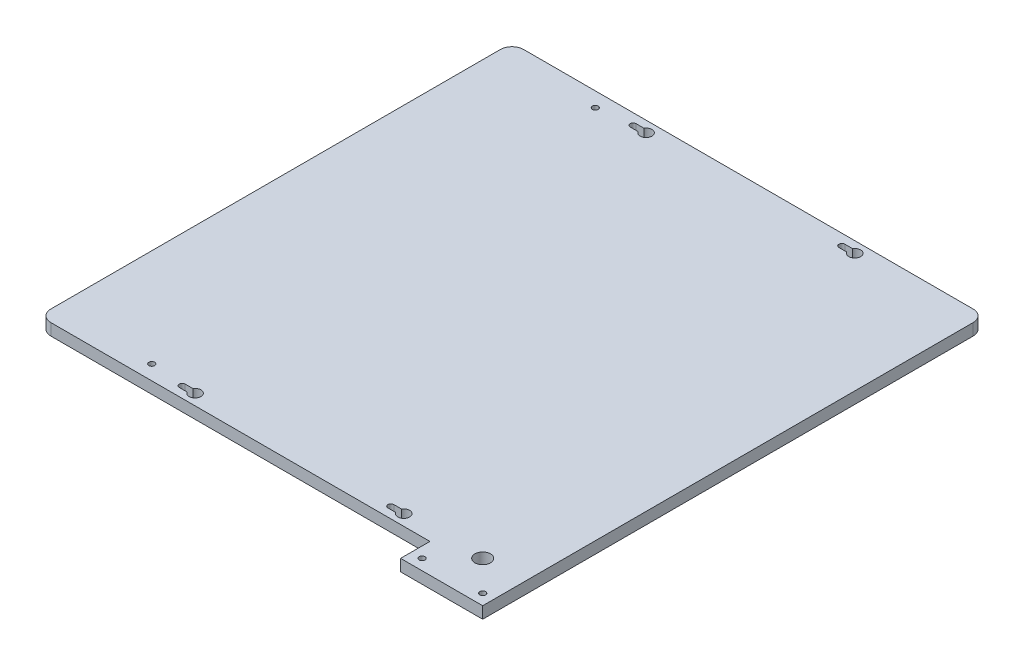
from build123d import *

# Parameters (mm, degrees)
SKETCH1_R           = 1.5
SKETCH1_R_2         = 4
BOSS_EXTRUDE1_DEPTH = 6
CUT_EXTRUDE1_DEPTH  = 183.134565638
CUT_EXTRUDE2_DEPTH  = 183.134565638
CUT_EXTRUDE3_DEPTH  = 183.134565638
CUT_EXTRUDE4_DEPTH  = 183.134565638
SKETCH6_W           = 3
SKETCH6_H           = 6
SKETCH7_W           = 3
SKETCH7_H           = 6
SKETCH8_W           = 3
SKETCH8_H           = 6
SKETCH9_W           = 3
SKETCH9_H           = 6
FILLET1_R           = 6


with BuildPart() as part:
    # Sketch1 → Boss-Extrude1 (new body)
    with BuildSketch(Plane(origin=(0, 3, 0), x_dir=(1, 0, 0), z_dir=(0, 1, 0))):
        Polygon((-121, 121), (-121, -121), (79, -121), (79, -136), (121, -136), (121, 121), align=None)
        with Locations(Location((-70.85, -113.5, 0), (0, 0, 270))):
            Circle(SKETCH1_R, mode=Mode.SUBTRACT)
        with Locations(Location((-70.85, 113.5, 0), (0, 0, 270))):
            Circle(SKETCH1_R, mode=Mode.SUBTRACT)
        with Locations(Location((100, -115, 0), (0, 0, 270))):
            Circle(SKETCH1_R_2, mode=Mode.SUBTRACT)
        with Locations(Location((115.5, -130.5, 0), (0, 0, 270))):
            Circle(SKETCH1_R, mode=Mode.SUBTRACT)
        with Locations(Location((84.5, -130.5, 0), (0, 0, 270))):
            Circle(SKETCH1_R, mode=Mode.SUBTRACT)
    extrude(amount=-BOSS_EXTRUDE1_DEPTH)

    # Sketch2 → Cut-Extrude1 (cut, through all)
    with BuildSketch(Plane(origin=(0, -3, 0), x_dir=(-1, 0, 0), z_dir=(0, 1, 0))):
        with BuildLine():
            Line((-57.401923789, -116.9), (-53.4, -116.9))
            ThreePointArc((-53.4, -116.9), (-51.9, -115.4), (-53.4, -113.9))
            Line((-53.4, -113.9), (-57.401923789, -113.9))
            ThreePointArc((-57.401923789, -113.9), (-57, -115.4), (-57.401923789, -116.9))
        make_face()
    extrude(amount=CUT_EXTRUDE1_DEPTH, mode=Mode.SUBTRACT)

    # Sketch3 → Cut-Extrude2 (cut, through all)
    with BuildSketch(Plane(origin=(0, -3, 0), x_dir=(-1, 0, 0), z_dir=(0, 1, 0))):
        with BuildLine():
            Line((49.398076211, -116.9), (53.4, -116.9))
            ThreePointArc((53.4, -116.9), (54.9, -115.4), (53.4, -113.9))
            Line((53.4, -113.9), (49.398076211, -113.9))
            ThreePointArc((49.398076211, -113.9), (49.8, -115.4), (49.398076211, -116.9))
        make_face()
    extrude(amount=CUT_EXTRUDE2_DEPTH, mode=Mode.SUBTRACT)

    # Sketch4 → Cut-Extrude3 (cut, through all)
    with BuildSketch(Plane(origin=(0, -3, 0), x_dir=(-1, 0, 0), z_dir=(0, 1, 0))):
        with BuildLine():
            Line((-57.401923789, 113.9), (-53.4, 113.9))
            ThreePointArc((-53.4, 113.9), (-51.9, 115.4), (-53.4, 116.9))
            Line((-53.4, 116.9), (-57.401923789, 116.9))
            ThreePointArc((-57.401923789, 116.9), (-57, 115.4), (-57.401923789, 113.9))
        make_face()
    extrude(amount=CUT_EXTRUDE3_DEPTH, mode=Mode.SUBTRACT)

    # Sketch5 → Cut-Extrude4 (cut, through all)
    with BuildSketch(Plane.XZ.offset(-3)):
        with BuildLine():
            Line((-53.4, 113.9), (-49.398076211, 113.9))
            ThreePointArc((-49.398076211, 113.9), (-49.8, 115.4), (-49.398076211, 116.9))
            Line((-49.398076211, 116.9), (-53.4, 116.9))
            ThreePointArc((-53.4, 116.9), (-54.9, 115.4), (-53.4, 113.9))
        make_face()
    extrude(amount=CUT_EXTRUDE4_DEPTH, mode=Mode.SUBTRACT)

    # Sketch6 → Cut-Revolve1 (revolve, cut)
    with BuildSketch(Plane.XY.offset(-115.4)):
        with Locations((61.5, 0)):
            Rectangle(SKETCH6_W, SKETCH6_H)
    revolve(axis=Axis((60, 3, -115.4), (0, -1, 0)), mode=Mode.SUBTRACT)

    # Sketch7 → Cut-Revolve2 (revolve, cut)
    with BuildSketch(Plane.XY.offset(-115.4)):
        with Locations((-45.3, 0)):
            Rectangle(SKETCH7_W, SKETCH7_H)
    revolve(axis=Axis((-46.8, 3, -115.4), (0, -1, 0)), mode=Mode.SUBTRACT)

    # Sketch8 → Cut-Revolve3 (revolve, cut)
    with BuildSketch(Plane.XY.offset(115.4)):
        with Locations((61.5, 0)):
            Rectangle(SKETCH8_W, SKETCH8_H)
    revolve(axis=Axis((60, 3, 115.4), (0, -1, 0)), mode=Mode.SUBTRACT)

    # Sketch9 → Cut-Revolve4 (revolve, cut)
    with BuildSketch(Plane.XY.offset(115.4)):
        with Locations((-45.3, 0)):
            Rectangle(SKETCH9_W, SKETCH9_H)
    revolve(axis=Axis((-46.8, 3, 115.4), (0, -1, 0)), mode=Mode.SUBTRACT)

    # Fillet1
    fillet1_edges = [part.edges().sort_by_distance(p)[0] for p in [
        (-121, 0, 121),
        (-121, 0, -121),
        (121, 0, -121),
    ]]
    fillet(fillet1_edges, radius=FILLET1_R)


solid = part.part
